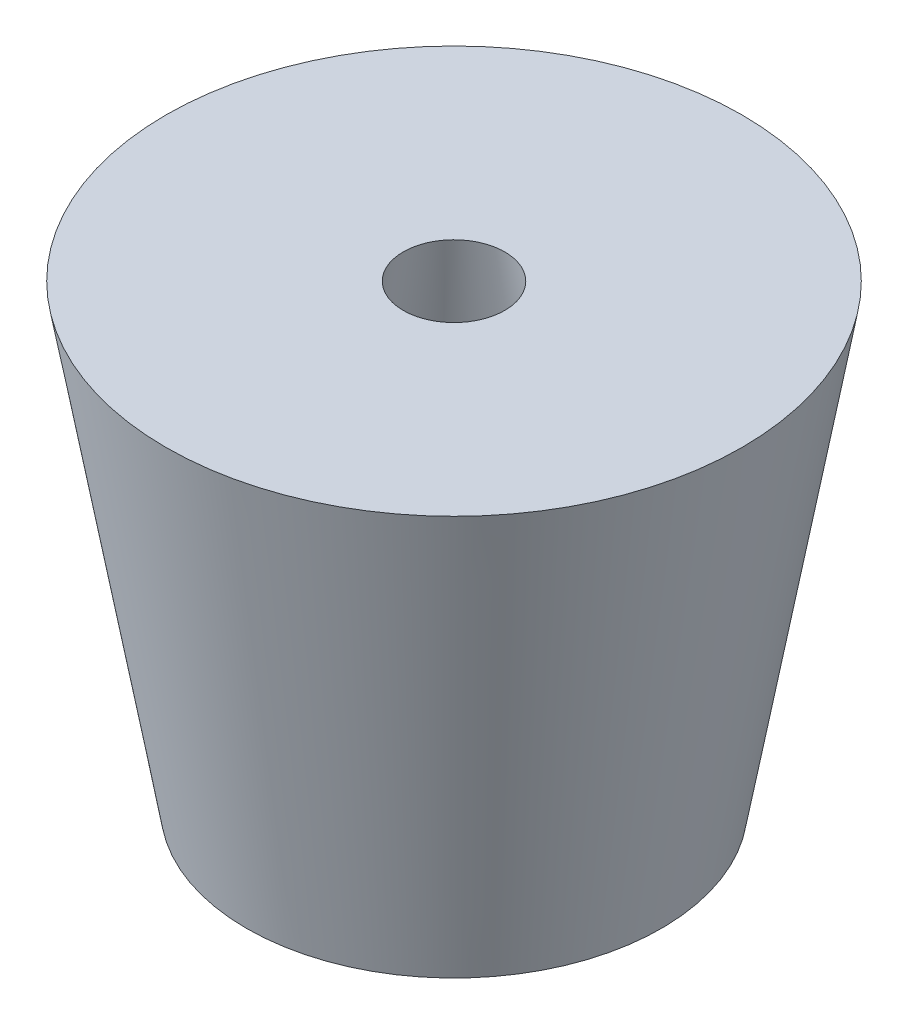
from build123d import *


with BuildPart() as part:
    # Sketch1 → Revolve1 (revolve)
    with BuildSketch(Plane.XY, mode=Mode.PRIVATE) as revolve1_sk:
        Polygon((20, -0.852861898), (113.477713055, -0.852861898), (81.738856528, -180.852861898), (51.738856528, -180.852861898), align=None)
    revolve(revolve1_sk.sketch.rotate(Axis((0, 0, 0), (0, -1, 0)), 90), axis=Axis((0, 0, 0), (0, -1, 0)))


solid = part.part
